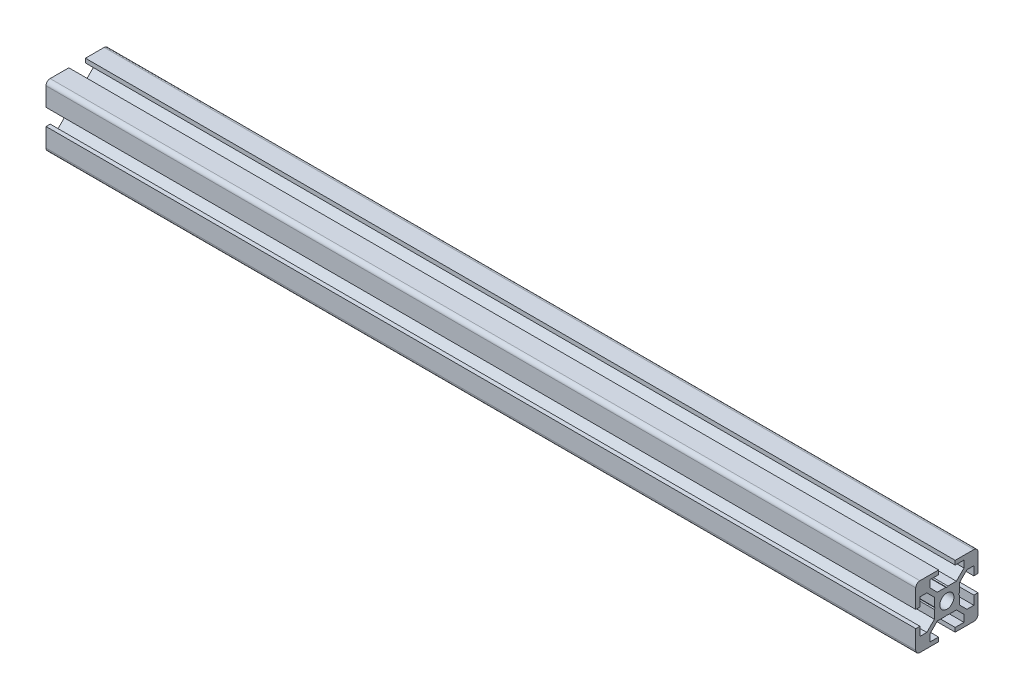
from build123d import *

# Parameters (mm, degrees)
SKETCH113_R             = 3.4
BOSS_EXTRUDE1_DEPTH     = 209.55
CUT_EXTRUDE1_DEPTH      = 211.620994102
CUT_EXTRUDE1_DEPTH_BACK = 211.620994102
SKETCH114_R             = 3.175


with BuildPart() as part:
    # Sketch113 → Boss-Extrude1 (new, symmetric)
    with BuildSketch(Plane(origin=(0, 0, 0), x_dir=(0, -1, 0), z_dir=(1, 0, 0))):
        with BuildLine():
            Line((15.000011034, -4.000010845), (13.000011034, -4.000010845))
            Line((13.000011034, -4.000010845), (13.000011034, -8.250010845))
            Line((13.000011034, -8.250010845), (9.664224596, -8.250010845))
            Line((9.664224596, -8.250010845), (6.000011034, -4.585797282))
            Line((6.000011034, -4.585797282), (6.000011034, -0.519626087))
            Line((6.000011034, -0.519626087), (5.700011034, -1.0845e-05))
            Line((5.700011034, -1.0845e-05), (6.000011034, 0.519604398))
            Line((6.000011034, 0.519604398), (6.000011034, 4.585775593))
            Line((6.000011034, 4.585775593), (9.664224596, 8.249989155))
            Line((9.664224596, 8.249989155), (13.000011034, 8.249989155))
            Line((13.000011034, 8.249989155), (13.000011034, 3.999989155))
            Line((13.000011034, 3.999989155), (15.000011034, 3.999989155))
            Line((15.000011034, 3.999989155), (15.000011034, 12.999989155))
            ThreePointArc((15.000011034, 12.999989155), (14.414224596, 14.414202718), (13.000011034, 14.999989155))
            Line((13.000011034, 14.999989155), (4.000011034, 14.999989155))
            Line((4.000011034, 14.999989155), (4.000011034, 12.999989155))
            Line((4.000011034, 12.999989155), (8.250011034, 12.999989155))
            Line((8.250011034, 12.999989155), (8.250011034, 9.664202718))
            Line((8.250011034, 9.664202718), (4.585797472, 5.999989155))
            Line((4.585797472, 5.999989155), (0.519626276, 5.999989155))
            Line((0.519626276, 5.999989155), (1.1034e-05, 5.699989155))
            Line((1.1034e-05, 5.699989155), (-0.519604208, 5.999989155))
            Line((-0.519604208, 5.999989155), (-4.585775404, 5.999989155))
            Line((-4.585775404, 5.999989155), (-8.249988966, 9.664202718))
            Line((-8.249988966, 9.664202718), (-8.249988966, 12.999989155))
            Line((-8.249988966, 12.999989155), (-3.999988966, 12.999989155))
            Line((-3.999988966, 12.999989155), (-3.999988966, 14.999989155))
            Line((-3.999988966, 14.999989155), (-12.999988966, 14.999989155))
            ThreePointArc((-12.999988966, 14.999989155), (-14.414202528, 14.414202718), (-14.999988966, 12.999989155))
            Line((-14.999988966, 12.999989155), (-14.999988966, 3.999989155))
            Line((-14.999988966, 3.999989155), (-12.999988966, 3.999989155))
            Line((-12.999988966, 3.999989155), (-12.999988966, 8.249989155))
            Line((-12.999988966, 8.249989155), (-9.664202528, 8.249989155))
            Line((-9.664202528, 8.249989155), (-5.999988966, 4.585775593))
            Line((-5.999988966, 4.585775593), (-5.999988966, 0.519604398))
            Line((-5.999988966, 0.519604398), (-5.699988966, -1.0845e-05))
            Line((-5.699988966, -1.0845e-05), (-5.999988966, -0.519626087))
            Line((-5.999988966, -0.519626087), (-5.999988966, -4.585797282))
            Line((-5.999988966, -4.585797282), (-9.664202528, -8.250010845))
            Line((-9.664202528, -8.250010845), (-12.999988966, -8.250010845))
            Line((-12.999988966, -8.250010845), (-12.999988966, -4.000010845))
            Line((-12.999988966, -4.000010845), (-14.999988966, -4.000010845))
            Line((-14.999988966, -4.000010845), (-14.999988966, -13.000010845))
            ThreePointArc((-14.999988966, -13.000010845), (-14.414202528, -14.414224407), (-12.999988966, -15.000010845))
            Line((-12.999988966, -15.000010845), (-3.999988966, -15.000010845))
            Line((-3.999988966, -15.000010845), (-3.999988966, -13.000010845))
            Line((-3.999988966, -13.000010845), (-8.249988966, -13.000010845))
            Line((-8.249988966, -13.000010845), (-8.249988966, -9.664224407))
            Line((-8.249988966, -9.664224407), (-4.585775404, -6.000010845))
            Line((-4.585775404, -6.000010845), (-0.519604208, -6.000010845))
            Line((-0.519604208, -6.000010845), (1.1034e-05, -5.700010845))
            Line((1.1034e-05, -5.700010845), (0.519626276, -6.000010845))
            Line((0.519626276, -6.000010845), (4.585797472, -6.000010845))
            Line((4.585797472, -6.000010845), (8.250011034, -9.664224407))
            Line((8.250011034, -9.664224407), (8.250011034, -13.000010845))
            Line((8.250011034, -13.000010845), (4.000011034, -13.000010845))
            Line((4.000011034, -13.000010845), (4.000011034, -15.000010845))
            Line((4.000011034, -15.000010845), (13.000011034, -15.000010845))
            ThreePointArc((13.000011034, -15.000010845), (14.414224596, -14.414224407), (15.000011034, -13.000010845))
            Line((15.000011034, -13.000010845), (15.000011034, -4.000010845))
        make_face()
        with Locations(Location((1.1034e-05, -1.0845e-05, 0), (0, 0, 270))):
            Circle(SKETCH113_R, mode=Mode.SUBTRACT)
    extrude(amount=BOSS_EXTRUDE1_DEPTH, both=True)

    # Sketch114 → Cut-Extrude1 (cut, two sides: drawn at the far end of the back side and taken through both)
    with BuildSketch(Plane.XY.offset(-CUT_EXTRUDE1_DEPTH_BACK)):
        Circle(SKETCH114_R)
    extrude(amount=CUT_EXTRUDE1_DEPTH + CUT_EXTRUDE1_DEPTH_BACK, mode=Mode.SUBTRACT)


solid = part.part
